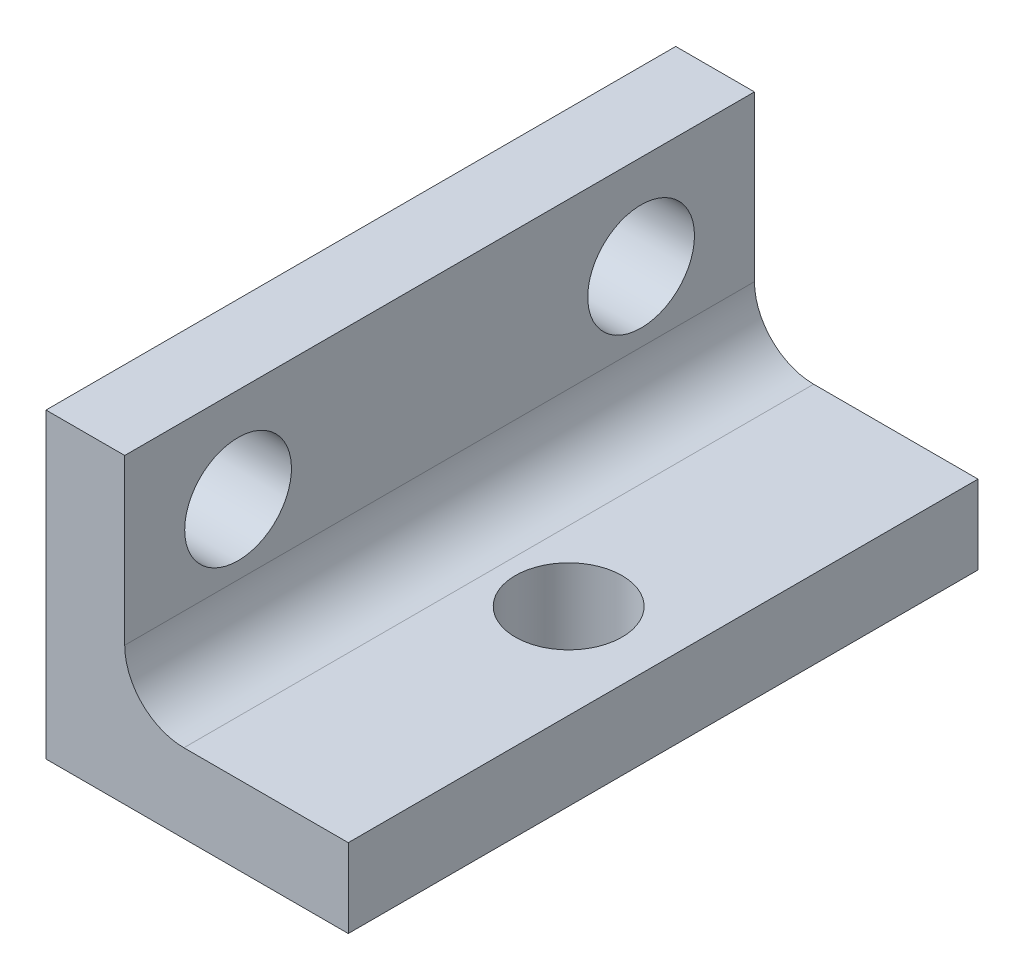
from build123d import *

# Parameters (mm, degrees)
EXTRUDE1_DEPTH                 = 12.7
F_18_0_169500_DIAMETER_HOLE2_D = 4.3053
F_18_0_169500_DIAMETER_HOLE3_D = 4.3053


with BuildPart() as part:
    # Sketch1 → Extrude1 (new body)
    with BuildSketch(Plane.XY):
        with BuildLine():
            Line((3.175, 12.192), (3.175, 5.5626))
            ThreePointArc((3.175, 5.5626), (3.874311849, 3.874311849), (5.5626, 3.175))
            Line((5.5626, 3.175), (12.192, 3.175))
            Line((12.192, 3.175), (12.192, 0))
            Line((12.192, 0), (0, 0))
            Line((0, 0), (0, 12.192))
            Line((0, 12.192), (3.175, 12.192))
        make_face()
    extrude(amount=EXTRUDE1_DEPTH)

    # 18 _0.169500_ Diameter Hole2 (through all)
    with Locations(Plane.ZY):
        with Locations((8.128, 8.382)):
            Hole(F_18_0_169500_DIAMETER_HOLE2_D / 2)

    # 18 _0.169500_ Diameter Hole3 (through all)
    with Locations(Plane.XZ):
        with Locations((8.382, 0)):
            Hole(F_18_0_169500_DIAMETER_HOLE3_D / 2)

    # Mirror1: part across face


with BuildPart() as part_1:
    add(part.part)
    add(part.part.mirror(Plane(origin=(2.248369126, 5.156206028, 0), x_dir=(1, 0, 0), z_dir=(0, 0, -1))))


solid = part_1.part
